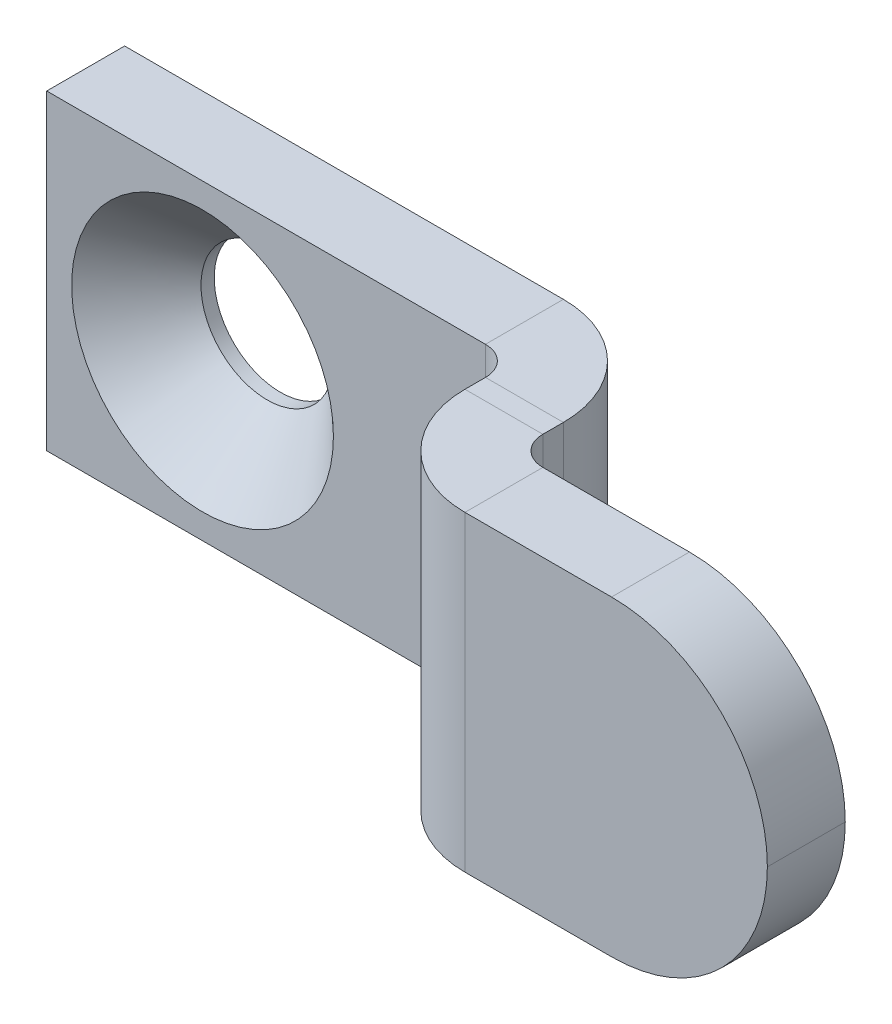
ISO-10303-21;
HEADER;
FILE_DESCRIPTION(('STEP AP214'),'2;1');
FILE_NAME('part.step','',(''),(''),'','','');
FILE_SCHEMA(('AUTOMOTIVE_DESIGN { 1 0 10303 214 1 1 1 1 }'));
ENDSEC;
DATA;
#1=APPLICATION_CONTEXT('core data for automotive mechanical design processes');
#2=APPLICATION_PROTOCOL_DEFINITION('international standard','automotive_design',2000,#1);
#3=PRODUCT_CONTEXT('',#1,'mechanical');
#4=PRODUCT('Part','Part','',(#3));
#5=PRODUCT_RELATED_PRODUCT_CATEGORY('part','',(#4));
#6=PRODUCT_DEFINITION_FORMATION('','',#4);
#7=PRODUCT_DEFINITION_CONTEXT('part definition',#1,'design');
#8=PRODUCT_DEFINITION('design','',#6,#7);
#9=PRODUCT_DEFINITION_SHAPE('','',#8);
#10=(LENGTH_UNIT() NAMED_UNIT(*) SI_UNIT(.MILLI.,.METRE.));
#11=(NAMED_UNIT(*) PLANE_ANGLE_UNIT() SI_UNIT($,.RADIAN.));
#12=(NAMED_UNIT(*) SI_UNIT($,.STERADIAN.) SOLID_ANGLE_UNIT());
#13=UNCERTAINTY_MEASURE_WITH_UNIT(LENGTH_MEASURE(1.E-05),#10,'distance_accuracy_value','');
#14=(GEOMETRIC_REPRESENTATION_CONTEXT(3) GLOBAL_UNCERTAINTY_ASSIGNED_CONTEXT((#13)) GLOBAL_UNIT_ASSIGNED_CONTEXT((#10,
#11,#12)) REPRESENTATION_CONTEXT('',''));
#15=CARTESIAN_POINT('',(0.,0.,0.));
#16=DIRECTION('',(0.,0.,1.));
#17=DIRECTION('',(1.,0.,0.));
#18=AXIS2_PLACEMENT_3D('',#15,#16,#17);
#19=CARTESIAN_POINT('',(20.,-4.,2.));
#20=DIRECTION('',(0.,1.,0.));
#21=DIRECTION('',(0.,0.,1.));
#22=AXIS2_PLACEMENT_3D('',#19,#20,#21);
#23=PLANE('',#22);
#24=DIRECTION('',(-1.,0.,0.));
#25=VECTOR('',#24,1.);
#26=CARTESIAN_POINT('',(20.,-4.,3.2634));
#27=LINE('',#26,#25);
#28=CARTESIAN_POINT('',(20.,-4.,3.2634));
#29=VERTEX_POINT('',#28);
#30=CARTESIAN_POINT('',(18.,-4.,3.2634));
#31=VERTEX_POINT('',#30);
#32=EDGE_CURVE('E154',#29,#31,#27,.T.);
#33=ORIENTED_EDGE('',*,*,#32,.T.);
#34=DIRECTION('',(0.,0.,1.));
#35=VECTOR('',#34,1.);
#36=CARTESIAN_POINT('',(18.,-4.,2.));
#37=LINE('',#36,#35);
#38=CARTESIAN_POINT('',(18.,-4.,2.7366));
#39=VERTEX_POINT('',#38);
#40=EDGE_CURVE('E173',#31,#39,#37,.F.);
#41=ORIENTED_EDGE('',*,*,#40,.T.);
#42=DIRECTION('',(-1.,0.,0.));
#43=VECTOR('',#42,1.);
#44=CARTESIAN_POINT('',(20.,-4.,2.7366));
#45=LINE('',#44,#43);
#46=CARTESIAN_POINT('',(20.,-4.,2.7366));
#47=VERTEX_POINT('',#46);
#48=EDGE_CURVE('E162',#39,#47,#45,.F.);
#49=ORIENTED_EDGE('',*,*,#48,.T.);
#50=DIRECTION('',(0.,0.,-1.));
#51=VECTOR('',#50,1.);
#52=CARTESIAN_POINT('',(20.,-4.,0.));
#53=LINE('',#52,#51);
#54=EDGE_CURVE('E168',#29,#47,#53,.T.);
#55=ORIENTED_EDGE('',*,*,#54,.F.);
#56=EDGE_LOOP('',(#33,#41,#49,#55));
#57=FACE_BOUND('',#56,.T.);
#58=ADVANCED_FACE('F16',(#57),#23,.F.);
#59=CARTESIAN_POINT('',(20.,4.,6.));
#60=DIRECTION('',(0.,-1.,0.));
#61=DIRECTION('',(0.,0.,-1.));
#62=AXIS2_PLACEMENT_3D('',#59,#60,#61);
#63=PLANE('',#62);
#64=DIRECTION('',(-1.,0.,0.));
#65=VECTOR('',#64,1.);
#66=CARTESIAN_POINT('',(20.,4.,3.2634));
#67=LINE('',#66,#65);
#68=CARTESIAN_POINT('',(20.,4.,3.2634));
#69=VERTEX_POINT('',#68);
#70=CARTESIAN_POINT('',(18.,4.,3.2634));
#71=VERTEX_POINT('',#70);
#72=EDGE_CURVE('E159',#69,#71,#67,.T.);
#73=ORIENTED_EDGE('',*,*,#72,.F.);
#74=DIRECTION('',(0.,0.,1.));
#75=VECTOR('',#74,1.);
#76=CARTESIAN_POINT('',(20.,4.,0.));
#77=LINE('',#76,#75);
#78=CARTESIAN_POINT('',(20.,4.,2.7366));
#79=VERTEX_POINT('',#78);
#80=EDGE_CURVE('E164',#79,#69,#77,.T.);
#81=ORIENTED_EDGE('',*,*,#80,.F.);
#82=DIRECTION('',(-1.,0.,0.));
#83=VECTOR('',#82,1.);
#84=CARTESIAN_POINT('',(18.,4.,2.7366));
#85=LINE('',#84,#83);
#86=CARTESIAN_POINT('',(18.,4.,2.7366));
#87=VERTEX_POINT('',#86);
#88=EDGE_CURVE('E178',#87,#79,#85,.F.);
#89=ORIENTED_EDGE('',*,*,#88,.F.);
#90=DIRECTION('',(0.,0.,-1.));
#91=VECTOR('',#90,1.);
#92=CARTESIAN_POINT('',(18.,4.,6.));
#93=LINE('',#92,#91);
#94=EDGE_CURVE('E170',#87,#71,#93,.F.);
#95=ORIENTED_EDGE('',*,*,#94,.T.);
#96=EDGE_LOOP('',(#73,#81,#89,#95));
#97=FACE_BOUND('',#96,.T.);
#98=ADVANCED_FACE('F268',(#97),#63,.F.);
#99=CARTESIAN_POINT('',(20.,0.,0.));
#100=DIRECTION('',(-1.,0.,0.));
#101=DIRECTION('',(0.,0.,1.));
#102=AXIS2_PLACEMENT_3D('',#99,#100,#101);
#103=PLANE('',#102);
#104=DIRECTION('',(0.,-1.,0.));
#105=VECTOR('',#104,1.);
#106=CARTESIAN_POINT('',(20.,-4.,3.2634));
#107=LINE('',#106,#105);
#108=EDGE_CURVE('E141',#29,#69,#107,.F.);
#109=ORIENTED_EDGE('',*,*,#108,.F.);
#110=ORIENTED_EDGE('',*,*,#54,.T.);
#111=DIRECTION('',(0.,1.,0.));
#112=VECTOR('',#111,1.);
#113=CARTESIAN_POINT('',(20.,-4.,2.7366));
#114=LINE('',#113,#112);
#115=EDGE_CURVE('E175',#79,#47,#114,.F.);
#116=ORIENTED_EDGE('',*,*,#115,.F.);
#117=ORIENTED_EDGE('',*,*,#80,.T.);
#118=EDGE_LOOP('',(#109,#110,#116,#117));
#119=FACE_BOUND('',#118,.T.);
#120=ADVANCED_FACE('F275',(#119),#103,.F.);
#121=CARTESIAN_POINT('',(18.,0.,0.));
#122=DIRECTION('',(-1.,0.,0.));
#123=DIRECTION('',(0.,0.,1.));
#124=AXIS2_PLACEMENT_3D('',#121,#122,#123);
#125=PLANE('',#124);
#126=ORIENTED_EDGE('',*,*,#40,.F.);
#127=DIRECTION('',(0.,-1.,0.));
#128=VECTOR('',#127,1.);
#129=CARTESIAN_POINT('',(18.,-4.,3.2634));
#130=LINE('',#129,#128);
#131=EDGE_CURVE('E119',#31,#71,#130,.F.);
#132=ORIENTED_EDGE('',*,*,#131,.T.);
#133=ORIENTED_EDGE('',*,*,#94,.F.);
#134=DIRECTION('',(0.,1.,0.));
#135=VECTOR('',#134,1.);
#136=CARTESIAN_POINT('',(18.,-4.,2.7366));
#137=LINE('',#136,#135);
#138=EDGE_CURVE('E181',#39,#87,#137,.T.);
#139=ORIENTED_EDGE('',*,*,#138,.F.);
#140=EDGE_LOOP('',(#126,#132,#133,#139));
#141=FACE_BOUND('',#140,.T.);
#142=ADVANCED_FACE('F321',(#141),#125,.T.);
#143=CARTESIAN_POINT('',(6.,-4.,2.));
#144=DIRECTION('',(0.,1.,0.));
#145=DIRECTION('',(-1.,0.,0.));
#146=AXIS2_PLACEMENT_3D('',#143,#144,#145);
#147=PLANE('',#146);
#148=DIRECTION('',(0.,0.,-1.));
#149=VECTOR('',#148,1.);
#150=CARTESIAN_POINT('',(17.2634,-4.,2.));
#151=LINE('',#150,#149);
#152=CARTESIAN_POINT('',(17.2634,-4.,2.));
#153=VERTEX_POINT('',#152);
#154=CARTESIAN_POINT('',(17.2634,-4.,0.));
#155=VERTEX_POINT('',#154);
#156=EDGE_CURVE('E202',#153,#155,#151,.T.);
#157=ORIENTED_EDGE('',*,*,#156,.F.);
#158=DIRECTION('',(1.,0.,0.));
#159=VECTOR('',#158,1.);
#160=CARTESIAN_POINT('',(6.,-4.,2.));
#161=LINE('',#160,#159);
#162=CARTESIAN_POINT('',(6.,-4.,2.));
#163=VERTEX_POINT('',#162);
#164=EDGE_CURVE('E219',#163,#153,#161,.T.);
#165=ORIENTED_EDGE('',*,*,#164,.F.);
#166=DIRECTION('',(0.,0.,-1.));
#167=VECTOR('',#166,1.);
#168=CARTESIAN_POINT('',(6.,-4.,2.));
#169=LINE('',#168,#167);
#170=CARTESIAN_POINT('',(6.,-4.,0.));
#171=VERTEX_POINT('',#170);
#172=EDGE_CURVE('E234',#163,#171,#169,.T.);
#173=ORIENTED_EDGE('',*,*,#172,.T.);
#174=DIRECTION('',(1.,0.,0.));
#175=VECTOR('',#174,1.);
#176=CARTESIAN_POINT('',(6.,-4.,0.));
#177=LINE('',#176,#175);
#178=EDGE_CURVE('E228',#171,#155,#177,.T.);
#179=ORIENTED_EDGE('',*,*,#178,.T.);
#180=EDGE_LOOP('',(#157,#165,#173,#179));
#181=FACE_BOUND('',#180,.T.);
#182=ADVANCED_FACE('F317',(#181),#147,.F.);
#183=CARTESIAN_POINT('',(6.,4.,2.));
#184=DIRECTION('',(0.,-1.,0.));
#185=DIRECTION('',(1.,0.,0.));
#186=AXIS2_PLACEMENT_3D('',#183,#184,#185);
#187=PLANE('',#186);
#188=DIRECTION('',(0.,0.,-1.));
#189=VECTOR('',#188,1.);
#190=CARTESIAN_POINT('',(17.2634,4.,2.));
#191=LINE('',#190,#189);
#192=CARTESIAN_POINT('',(17.2634,4.,2.));
#193=VERTEX_POINT('',#192);
#194=CARTESIAN_POINT('',(17.2634,4.,0.));
#195=VERTEX_POINT('',#194);
#196=EDGE_CURVE('E191',#193,#195,#191,.T.);
#197=ORIENTED_EDGE('',*,*,#196,.T.);
#198=DIRECTION('',(-1.,0.,0.));
#199=VECTOR('',#198,1.);
#200=CARTESIAN_POINT('',(6.,4.,0.));
#201=LINE('',#200,#199);
#202=CARTESIAN_POINT('',(6.,4.,0.));
#203=VERTEX_POINT('',#202);
#204=EDGE_CURVE('E220',#195,#203,#201,.T.);
#205=ORIENTED_EDGE('',*,*,#204,.T.);
#206=DIRECTION('',(0.,0.,-1.));
#207=VECTOR('',#206,1.);
#208=CARTESIAN_POINT('',(6.,4.,2.));
#209=LINE('',#208,#207);
#210=CARTESIAN_POINT('',(6.,4.,2.));
#211=VERTEX_POINT('',#210);
#212=EDGE_CURVE('E225',#211,#203,#209,.T.);
#213=ORIENTED_EDGE('',*,*,#212,.F.);
#214=DIRECTION('',(-1.,0.,0.));
#215=VECTOR('',#214,1.);
#216=CARTESIAN_POINT('',(6.,4.,2.));
#217=LINE('',#216,#215);
#218=EDGE_CURVE('E223',#193,#211,#217,.T.);
#219=ORIENTED_EDGE('',*,*,#218,.F.);
#220=EDGE_LOOP('',(#197,#205,#213,#219));
#221=FACE_BOUND('',#220,.T.);
#222=ADVANCED_FACE('F310',(#221),#187,.F.);
#223=CARTESIAN_POINT('',(0.,0.,2.));
#224=DIRECTION('',(0.,0.,1.));
#225=DIRECTION('',(1.,0.,0.));
#226=AXIS2_PLACEMENT_3D('',#223,#224,#225);
#227=PLANE('',#226);
#228=CARTESIAN_POINT('',(10.,0.,2.));
#229=DIRECTION('',(0.,0.,1.));
#230=DIRECTION('',(1.,0.,0.));
#231=AXIS2_PLACEMENT_3D('',#228,#229,#230);
#232=CIRCLE('',#231,3.36);
#233=CARTESIAN_POINT('',(13.36,0.,2.));
#234=VERTEX_POINT('',#233);
#235=EDGE_CURVE('E205',#234,#234,#232,.T.);
#236=ORIENTED_EDGE('',*,*,#235,.F.);
#237=EDGE_LOOP('',(#236));
#238=FACE_BOUND('',#237,.T.);
#239=ORIENTED_EDGE('',*,*,#164,.T.);
#240=DIRECTION('',(0.,1.,0.));
#241=VECTOR('',#240,1.);
#242=CARTESIAN_POINT('',(17.2634,4.,2.));
#243=LINE('',#242,#241);
#244=EDGE_CURVE('E197',#193,#153,#243,.F.);
#245=ORIENTED_EDGE('',*,*,#244,.F.);
#246=ORIENTED_EDGE('',*,*,#218,.T.);
#247=DIRECTION('',(0.,-1.,0.));
#248=VECTOR('',#247,1.);
#249=CARTESIAN_POINT('',(6.,4.,2.));
#250=LINE('',#249,#248);
#251=EDGE_CURVE('E216',#211,#163,#250,.T.);
#252=ORIENTED_EDGE('',*,*,#251,.T.);
#253=EDGE_LOOP('',(#239,#245,#246,#252));
#254=FACE_BOUND('',#253,.T.);
#255=ADVANCED_FACE('F306',(#238,#254),#227,.T.);
#256=CARTESIAN_POINT('',(0.,0.,0.));
#257=DIRECTION('',(0.,0.,1.));
#258=DIRECTION('',(1.,0.,0.));
#259=AXIS2_PLACEMENT_3D('',#256,#257,#258);
#260=PLANE('',#259);
#261=CARTESIAN_POINT('',(10.,0.,0.));
#262=DIRECTION('',(0.,0.,1.));
#263=DIRECTION('',(1.,0.,0.));
#264=AXIS2_PLACEMENT_3D('',#261,#262,#263);
#265=CIRCLE('',#264,1.7);
#266=CARTESIAN_POINT('',(11.7,0.,0.));
#267=VERTEX_POINT('',#266);
#268=EDGE_CURVE('E212',#267,#267,#265,.T.);
#269=ORIENTED_EDGE('',*,*,#268,.T.);
#270=EDGE_LOOP('',(#269));
#271=FACE_BOUND('',#270,.T.);
#272=DIRECTION('',(0.,1.,0.));
#273=VECTOR('',#272,1.);
#274=CARTESIAN_POINT('',(17.2634,4.,0.));
#275=LINE('',#274,#273);
#276=EDGE_CURVE('E185',#195,#155,#275,.F.);
#277=ORIENTED_EDGE('',*,*,#276,.T.);
#278=ORIENTED_EDGE('',*,*,#178,.F.);
#279=DIRECTION('',(0.,-1.,0.));
#280=VECTOR('',#279,1.);
#281=CARTESIAN_POINT('',(6.,4.,0.));
#282=LINE('',#281,#280);
#283=EDGE_CURVE('E215',#203,#171,#282,.T.);
#284=ORIENTED_EDGE('',*,*,#283,.F.);
#285=ORIENTED_EDGE('',*,*,#204,.F.);
#286=EDGE_LOOP('',(#277,#278,#284,#285));
#287=FACE_BOUND('',#286,.T.);
#288=ADVANCED_FACE('F309',(#271,#287),#260,.F.);
#289=CARTESIAN_POINT('',(6.,4.,2.));
#290=DIRECTION('',(1.,0.,0.));
#291=DIRECTION('',(0.,0.,-1.));
#292=AXIS2_PLACEMENT_3D('',#289,#290,#291);
#293=PLANE('',#292);
#294=ORIENTED_EDGE('',*,*,#283,.T.);
#295=ORIENTED_EDGE('',*,*,#172,.F.);
#296=ORIENTED_EDGE('',*,*,#251,.F.);
#297=ORIENTED_EDGE('',*,*,#212,.T.);
#298=EDGE_LOOP('',(#294,#295,#296,#297));
#299=FACE_BOUND('',#298,.T.);
#300=ADVANCED_FACE('F304',(#299),#293,.F.);
#301=CARTESIAN_POINT('',(10.,0.,2.));
#302=DIRECTION('',(0.,0.,1.));
#303=DIRECTION('',(1.,0.,0.));
#304=AXIS2_PLACEMENT_3D('',#301,#302,#303);
#305=CYLINDRICAL_SURFACE('',#304,1.7);
#306=ORIENTED_EDGE('',*,*,#268,.F.);
#307=EDGE_LOOP('',(#306));
#308=FACE_BOUND('',#307,.T.);
#309=CARTESIAN_POINT('',(10.,0.,0.34));
#310=DIRECTION('',(0.,0.,1.));
#311=DIRECTION('',(1.,0.,0.));
#312=AXIS2_PLACEMENT_3D('',#309,#310,#311);
#313=CIRCLE('',#312,1.7);
#314=CARTESIAN_POINT('',(11.7,0.,0.34));
#315=VERTEX_POINT('',#314);
#316=EDGE_CURVE('E209',#315,#315,#313,.T.);
#317=ORIENTED_EDGE('',*,*,#316,.T.);
#318=EDGE_LOOP('',(#317));
#319=FACE_BOUND('',#318,.T.);
#320=ADVANCED_FACE('F300',(#308,#319),#305,.F.);
#321=CARTESIAN_POINT('',(10.,0.,2.));
#322=DIRECTION('',(0.,0.,1.));
#323=DIRECTION('',(1.,0.,0.));
#324=AXIS2_PLACEMENT_3D('',#321,#322,#323);
#325=CONICAL_SURFACE('',#324,3.36,0.785398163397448);
#326=ORIENTED_EDGE('',*,*,#316,.F.);
#327=EDGE_LOOP('',(#326));
#328=FACE_BOUND('',#327,.T.);
#329=ORIENTED_EDGE('',*,*,#235,.T.);
#330=EDGE_LOOP('',(#329));
#331=FACE_BOUND('',#330,.T.);
#332=ADVANCED_FACE('F293',(#328,#331),#325,.F.);
#333=CARTESIAN_POINT('',(17.2634,-4.,2.7366));
#334=DIRECTION('',(0.,-1.,0.));
#335=DIRECTION('',(0.,0.,-1.));
#336=AXIS2_PLACEMENT_3D('',#333,#334,#335);
#337=PLANE('',#336);
#338=ORIENTED_EDGE('',*,*,#48,.F.);
#339=CARTESIAN_POINT('',(17.2634,-4.,2.7366));
#340=DIRECTION('',(0.,1.,0.));
#341=DIRECTION('',(0.,0.,1.));
#342=AXIS2_PLACEMENT_3D('',#339,#340,#341);
#343=CIRCLE('',#342,0.7366);
#344=EDGE_CURVE('E194',#153,#39,#343,.F.);
#345=ORIENTED_EDGE('',*,*,#344,.F.);
#346=ORIENTED_EDGE('',*,*,#156,.T.);
#347=CARTESIAN_POINT('',(17.2634,-4.,2.7366));
#348=DIRECTION('',(0.,1.,0.));
#349=DIRECTION('',(0.,0.,1.));
#350=AXIS2_PLACEMENT_3D('',#347,#348,#349);
#351=CIRCLE('',#350,2.7366);
#352=EDGE_CURVE('E187',#155,#47,#351,.F.);
#353=ORIENTED_EDGE('',*,*,#352,.T.);
#354=EDGE_LOOP('',(#338,#345,#346,#353));
#355=FACE_BOUND('',#354,.T.);
#356=ADVANCED_FACE('F290',(#355),#337,.T.);
#357=CARTESIAN_POINT('',(17.2634,4.,2.7366));
#358=DIRECTION('',(0.,-1.,0.));
#359=DIRECTION('',(0.,0.,-1.));
#360=AXIS2_PLACEMENT_3D('',#357,#358,#359);
#361=PLANE('',#360);
#362=CARTESIAN_POINT('',(17.2634,4.,2.7366));
#363=DIRECTION('',(0.,1.,0.));
#364=DIRECTION('',(0.,0.,1.));
#365=AXIS2_PLACEMENT_3D('',#362,#363,#364);
#366=CIRCLE('',#365,0.7366);
#367=EDGE_CURVE('E167',#87,#193,#366,.T.);
#368=ORIENTED_EDGE('',*,*,#367,.F.);
#369=ORIENTED_EDGE('',*,*,#88,.T.);
#370=CARTESIAN_POINT('',(17.2634,4.,2.7366));
#371=DIRECTION('',(0.,1.,0.));
#372=DIRECTION('',(0.,0.,1.));
#373=AXIS2_PLACEMENT_3D('',#370,#371,#372);
#374=CIRCLE('',#373,2.7366);
#375=EDGE_CURVE('E188',#79,#195,#374,.T.);
#376=ORIENTED_EDGE('',*,*,#375,.T.);
#377=ORIENTED_EDGE('',*,*,#196,.F.);
#378=EDGE_LOOP('',(#368,#369,#376,#377));
#379=FACE_BOUND('',#378,.T.);
#380=ADVANCED_FACE('F284',(#379),#361,.F.);
#381=CARTESIAN_POINT('',(17.2634,4.,2.7366));
#382=DIRECTION('',(0.,1.,0.));
#383=DIRECTION('',(1.,0.,0.));
#384=AXIS2_PLACEMENT_3D('',#381,#382,#383);
#385=CYLINDRICAL_SURFACE('',#384,2.7366);
#386=ORIENTED_EDGE('',*,*,#276,.F.);
#387=ORIENTED_EDGE('',*,*,#375,.F.);
#388=ORIENTED_EDGE('',*,*,#115,.T.);
#389=ORIENTED_EDGE('',*,*,#352,.F.);
#390=EDGE_LOOP('',(#386,#387,#388,#389));
#391=FACE_BOUND('',#390,.T.);
#392=ADVANCED_FACE('F280',(#391),#385,.T.);
#393=CARTESIAN_POINT('',(17.2634,4.,2.7366));
#394=DIRECTION('',(0.,1.,0.));
#395=DIRECTION('',(1.,0.,0.));
#396=AXIS2_PLACEMENT_3D('',#393,#394,#395);
#397=CYLINDRICAL_SURFACE('',#396,0.7366);
#398=ORIENTED_EDGE('',*,*,#244,.T.);
#399=ORIENTED_EDGE('',*,*,#344,.T.);
#400=ORIENTED_EDGE('',*,*,#138,.T.);
#401=ORIENTED_EDGE('',*,*,#367,.T.);
#402=EDGE_LOOP('',(#398,#399,#400,#401));
#403=FACE_BOUND('',#402,.T.);
#404=ADVANCED_FACE('F283',(#403),#397,.F.);
#405=CARTESIAN_POINT('',(20.7366,4.,3.2634));
#406=DIRECTION('',(0.,1.,0.));
#407=DIRECTION('',(0.,0.,1.));
#408=AXIS2_PLACEMENT_3D('',#405,#406,#407);
#409=PLANE('',#408);
#410=DIRECTION('',(0.,0.,-1.));
#411=VECTOR('',#410,1.);
#412=CARTESIAN_POINT('',(20.7366,4.,6.));
#413=LINE('',#412,#411);
#414=CARTESIAN_POINT('',(20.7366,4.,4.));
#415=VERTEX_POINT('',#414);
#416=CARTESIAN_POINT('',(20.7366,4.,6.));
#417=VERTEX_POINT('',#416);
#418=EDGE_CURVE('E149',#415,#417,#413,.F.);
#419=ORIENTED_EDGE('',*,*,#418,.F.);
#420=CARTESIAN_POINT('',(20.7366,4.,3.2634));
#421=DIRECTION('',(0.,-1.,0.));
#422=DIRECTION('',(0.,0.,-1.));
#423=AXIS2_PLACEMENT_3D('',#420,#421,#422);
#424=CIRCLE('',#423,0.7366);
#425=EDGE_CURVE('E122',#69,#415,#424,.F.);
#426=ORIENTED_EDGE('',*,*,#425,.F.);
#427=ORIENTED_EDGE('',*,*,#72,.T.);
#428=CARTESIAN_POINT('',(20.7366,4.,3.2634));
#429=DIRECTION('',(0.,-1.,0.));
#430=DIRECTION('',(0.,0.,-1.));
#431=AXIS2_PLACEMENT_3D('',#428,#429,#430);
#432=CIRCLE('',#431,2.7366);
#433=EDGE_CURVE('E153',#71,#417,#432,.F.);
#434=ORIENTED_EDGE('',*,*,#433,.T.);
#435=EDGE_LOOP('',(#419,#426,#427,#434));
#436=FACE_BOUND('',#435,.T.);
#437=ADVANCED_FACE('F288',(#436),#409,.T.);
#438=CARTESIAN_POINT('',(20.7366,-4.,3.2634));
#439=DIRECTION('',(0.,1.,0.));
#440=DIRECTION('',(0.,0.,1.));
#441=AXIS2_PLACEMENT_3D('',#438,#439,#440);
#442=PLANE('',#441);
#443=CARTESIAN_POINT('',(20.7366,-4.,3.2634));
#444=DIRECTION('',(0.,-1.,0.));
#445=DIRECTION('',(0.,0.,-1.));
#446=AXIS2_PLACEMENT_3D('',#443,#444,#445);
#447=CIRCLE('',#446,0.7366);
#448=CARTESIAN_POINT('',(20.7366,-4.,4.));
#449=VERTEX_POINT('',#448);
#450=EDGE_CURVE('E129',#449,#29,#447,.T.);
#451=ORIENTED_EDGE('',*,*,#450,.F.);
#452=DIRECTION('',(0.,0.,-1.));
#453=VECTOR('',#452,1.);
#454=CARTESIAN_POINT('',(20.7366,-4.,4.));
#455=LINE('',#454,#453);
#456=CARTESIAN_POINT('',(20.7366,-4.,6.));
#457=VERTEX_POINT('',#456);
#458=EDGE_CURVE('E126',#449,#457,#455,.F.);
#459=ORIENTED_EDGE('',*,*,#458,.T.);
#460=CARTESIAN_POINT('',(20.7366,-4.,3.2634));
#461=DIRECTION('',(0.,-1.,0.));
#462=DIRECTION('',(0.,0.,-1.));
#463=AXIS2_PLACEMENT_3D('',#460,#461,#462);
#464=CIRCLE('',#463,2.7366);
#465=EDGE_CURVE('E112',#457,#31,#464,.T.);
#466=ORIENTED_EDGE('',*,*,#465,.T.);
#467=ORIENTED_EDGE('',*,*,#32,.F.);
#468=EDGE_LOOP('',(#451,#459,#466,#467));
#469=FACE_BOUND('',#468,.T.);
#470=ADVANCED_FACE('F127',(#469),#442,.F.);
#471=CARTESIAN_POINT('',(20.7366,-4.,3.2634));
#472=DIRECTION('',(0.,-1.,0.));
#473=DIRECTION('',(0.,0.,1.));
#474=AXIS2_PLACEMENT_3D('',#471,#472,#473);
#475=CYLINDRICAL_SURFACE('',#474,2.7366);
#476=ORIENTED_EDGE('',*,*,#131,.F.);
#477=ORIENTED_EDGE('',*,*,#465,.F.);
#478=DIRECTION('',(0.,-1.,0.));
#479=VECTOR('',#478,1.);
#480=CARTESIAN_POINT('',(20.7366,4.,6.));
#481=LINE('',#480,#479);
#482=EDGE_CURVE('E116',#457,#417,#481,.F.);
#483=ORIENTED_EDGE('',*,*,#482,.T.);
#484=ORIENTED_EDGE('',*,*,#433,.F.);
#485=EDGE_LOOP('',(#476,#477,#483,#484));
#486=FACE_BOUND('',#485,.T.);
#487=ADVANCED_FACE('F114',(#486),#475,.T.);
#488=CARTESIAN_POINT('',(20.7366,-4.,3.2634));
#489=DIRECTION('',(0.,-1.,0.));
#490=DIRECTION('',(0.,0.,1.));
#491=AXIS2_PLACEMENT_3D('',#488,#489,#490);
#492=CYLINDRICAL_SURFACE('',#491,0.7366);
#493=ORIENTED_EDGE('',*,*,#108,.T.);
#494=ORIENTED_EDGE('',*,*,#425,.T.);
#495=DIRECTION('',(0.,-1.,0.));
#496=VECTOR('',#495,1.);
#497=CARTESIAN_POINT('',(20.7366,4.,4.));
#498=LINE('',#497,#496);
#499=EDGE_CURVE('E131',#415,#449,#498,.T.);
#500=ORIENTED_EDGE('',*,*,#499,.T.);
#501=ORIENTED_EDGE('',*,*,#450,.T.);
#502=EDGE_LOOP('',(#493,#494,#500,#501));
#503=FACE_BOUND('',#502,.T.);
#504=ADVANCED_FACE('F354',(#503),#492,.F.);
#505=CARTESIAN_POINT('',(20.,4.,6.));
#506=DIRECTION('',(0.,-1.,0.));
#507=DIRECTION('',(0.,0.,-1.));
#508=AXIS2_PLACEMENT_3D('',#505,#506,#507);
#509=PLANE('',#508);
#510=DIRECTION('',(-1.,0.,0.));
#511=VECTOR('',#510,1.);
#512=CARTESIAN_POINT('',(0.,4.,6.));
#513=LINE('',#512,#511);
#514=CARTESIAN_POINT('',(24.5,4.,6.));
#515=VERTEX_POINT('',#514);
#516=EDGE_CURVE('E136',#515,#417,#513,.T.);
#517=ORIENTED_EDGE('',*,*,#516,.F.);
#518=DIRECTION('',(0.,0.,-1.));
#519=VECTOR('',#518,1.);
#520=CARTESIAN_POINT('',(24.5,4.,6.));
#521=LINE('',#520,#519);
#522=CARTESIAN_POINT('',(24.5,4.,4.));
#523=VERTEX_POINT('',#522);
#524=EDGE_CURVE('E237',#515,#523,#521,.T.);
#525=ORIENTED_EDGE('',*,*,#524,.T.);
#526=DIRECTION('',(1.,0.,0.));
#527=VECTOR('',#526,1.);
#528=CARTESIAN_POINT('',(20.,4.,4.));
#529=LINE('',#528,#527);
#530=EDGE_CURVE('E137',#523,#415,#529,.F.);
#531=ORIENTED_EDGE('',*,*,#530,.T.);
#532=ORIENTED_EDGE('',*,*,#418,.T.);
#533=EDGE_LOOP('',(#517,#525,#531,#532));
#534=FACE_BOUND('',#533,.T.);
#535=ADVANCED_FACE('F250',(#534),#509,.F.);
#536=CARTESIAN_POINT('',(28.5,-4.,6.));
#537=DIRECTION('',(0.,1.,0.));
#538=DIRECTION('',(0.,0.,1.));
#539=AXIS2_PLACEMENT_3D('',#536,#537,#538);
#540=PLANE('',#539);
#541=DIRECTION('',(-1.,0.,0.));
#542=VECTOR('',#541,1.);
#543=CARTESIAN_POINT('',(28.5,-4.,4.));
#544=LINE('',#543,#542);
#545=CARTESIAN_POINT('',(24.5,-4.,4.));
#546=VERTEX_POINT('',#545);
#547=EDGE_CURVE('E143',#449,#546,#544,.F.);
#548=ORIENTED_EDGE('',*,*,#547,.T.);
#549=DIRECTION('',(0.,0.,-1.));
#550=VECTOR('',#549,1.);
#551=CARTESIAN_POINT('',(24.5,-4.,6.));
#552=LINE('',#551,#550);
#553=CARTESIAN_POINT('',(24.5,-4.,6.));
#554=VERTEX_POINT('',#553);
#555=EDGE_CURVE('E11',#546,#554,#552,.F.);
#556=ORIENTED_EDGE('',*,*,#555,.T.);
#557=DIRECTION('',(1.,0.,0.));
#558=VECTOR('',#557,1.);
#559=CARTESIAN_POINT('',(0.,-4.,6.));
#560=LINE('',#559,#558);
#561=EDGE_CURVE('E134',#457,#554,#560,.T.);
#562=ORIENTED_EDGE('',*,*,#561,.F.);
#563=ORIENTED_EDGE('',*,*,#458,.F.);
#564=EDGE_LOOP('',(#548,#556,#562,#563));
#565=FACE_BOUND('',#564,.T.);
#566=ADVANCED_FACE('F139',(#565),#540,.F.);
#567=CARTESIAN_POINT('',(0.,0.,6.));
#568=DIRECTION('',(0.,0.,-1.));
#569=DIRECTION('',(-1.,0.,0.));
#570=AXIS2_PLACEMENT_3D('',#567,#568,#569);
#571=PLANE('',#570);
#572=CARTESIAN_POINT('',(24.5,0.,6.));
#573=DIRECTION('',(0.,0.,-1.));
#574=DIRECTION('',(-1.,0.,0.));
#575=AXIS2_PLACEMENT_3D('',#572,#573,#574);
#576=CIRCLE('',#575,4.);
#577=CARTESIAN_POINT('',(28.5,0.,6.));
#578=VERTEX_POINT('',#577);
#579=EDGE_CURVE('E32',#554,#578,#576,.F.);
#580=ORIENTED_EDGE('',*,*,#579,.T.);
#581=CARTESIAN_POINT('',(24.5,0.,6.));
#582=DIRECTION('',(0.,0.,-1.));
#583=DIRECTION('',(-1.,0.,0.));
#584=AXIS2_PLACEMENT_3D('',#581,#582,#583);
#585=CIRCLE('',#584,4.);
#586=EDGE_CURVE('E25',#578,#515,#585,.F.);
#587=ORIENTED_EDGE('',*,*,#586,.T.);
#588=ORIENTED_EDGE('',*,*,#516,.T.);
#589=ORIENTED_EDGE('',*,*,#482,.F.);
#590=ORIENTED_EDGE('',*,*,#561,.T.);
#591=EDGE_LOOP('',(#580,#587,#588,#589,#590));
#592=FACE_BOUND('',#591,.T.);
#593=ADVANCED_FACE('F133',(#592),#571,.F.);
#594=CARTESIAN_POINT('',(0.,0.,4.));
#595=DIRECTION('',(0.,0.,-1.));
#596=DIRECTION('',(-1.,0.,0.));
#597=AXIS2_PLACEMENT_3D('',#594,#595,#596);
#598=PLANE('',#597);
#599=ORIENTED_EDGE('',*,*,#530,.F.);
#600=CARTESIAN_POINT('',(24.5,0.,4.));
#601=DIRECTION('',(0.,0.,-1.));
#602=DIRECTION('',(-1.,0.,0.));
#603=AXIS2_PLACEMENT_3D('',#600,#601,#602);
#604=CIRCLE('',#603,4.);
#605=CARTESIAN_POINT('',(28.5,0.,4.));
#606=VERTEX_POINT('',#605);
#607=EDGE_CURVE('E242',#523,#606,#604,.T.);
#608=ORIENTED_EDGE('',*,*,#607,.T.);
#609=CARTESIAN_POINT('',(24.5,0.,4.));
#610=DIRECTION('',(0.,0.,-1.));
#611=DIRECTION('',(-1.,0.,0.));
#612=AXIS2_PLACEMENT_3D('',#609,#610,#611);
#613=CIRCLE('',#612,4.);
#614=EDGE_CURVE('E240',#606,#546,#613,.T.);
#615=ORIENTED_EDGE('',*,*,#614,.T.);
#616=ORIENTED_EDGE('',*,*,#547,.F.);
#617=ORIENTED_EDGE('',*,*,#499,.F.);
#618=EDGE_LOOP('',(#599,#608,#615,#616,#617));
#619=FACE_BOUND('',#618,.T.);
#620=ADVANCED_FACE('F256',(#619),#598,.T.);
#621=CARTESIAN_POINT('',(24.5,0.,6.));
#622=DIRECTION('',(0.,0.,-1.));
#623=DIRECTION('',(-1.,0.,0.));
#624=AXIS2_PLACEMENT_3D('',#621,#622,#623);
#625=CYLINDRICAL_SURFACE('',#624,4.);
#626=DIRECTION('',(0.,0.,-1.));
#627=VECTOR('',#626,1.);
#628=CARTESIAN_POINT('',(28.5,0.,6.));
#629=LINE('',#628,#627);
#630=EDGE_CURVE('E20',#578,#606,#629,.T.);
#631=ORIENTED_EDGE('',*,*,#630,.F.);
#632=ORIENTED_EDGE('',*,*,#579,.F.);
#633=ORIENTED_EDGE('',*,*,#555,.F.);
#634=ORIENTED_EDGE('',*,*,#614,.F.);
#635=EDGE_LOOP('',(#631,#632,#633,#634));
#636=FACE_BOUND('',#635,.T.);
#637=ADVANCED_FACE('F18',(#636),#625,.T.);
#638=CARTESIAN_POINT('',(24.5,0.,6.));
#639=DIRECTION('',(0.,0.,-1.));
#640=DIRECTION('',(-1.,0.,0.));
#641=AXIS2_PLACEMENT_3D('',#638,#639,#640);
#642=CYLINDRICAL_SURFACE('',#641,4.);
#643=ORIENTED_EDGE('',*,*,#586,.F.);
#644=ORIENTED_EDGE('',*,*,#630,.T.);
#645=ORIENTED_EDGE('',*,*,#607,.F.);
#646=ORIENTED_EDGE('',*,*,#524,.F.);
#647=EDGE_LOOP('',(#643,#644,#645,#646));
#648=FACE_BOUND('',#647,.T.);
#649=ADVANCED_FACE('F253',(#648),#642,.T.);
#650=CLOSED_SHELL('',(#58,#98,#120,#142,#182,#222,#255,#288,#300,#320,#332,#356,#380,#392,#404,
#437,#470,#487,#504,#535,#566,#593,#620,#637,#649));
#651=MANIFOLD_SOLID_BREP('B1',#650);
#652=ADVANCED_BREP_SHAPE_REPRESENTATION('',(#18,#651),#14);
#653=SHAPE_DEFINITION_REPRESENTATION(#9,#652);
ENDSEC;
END-ISO-10303-21;
